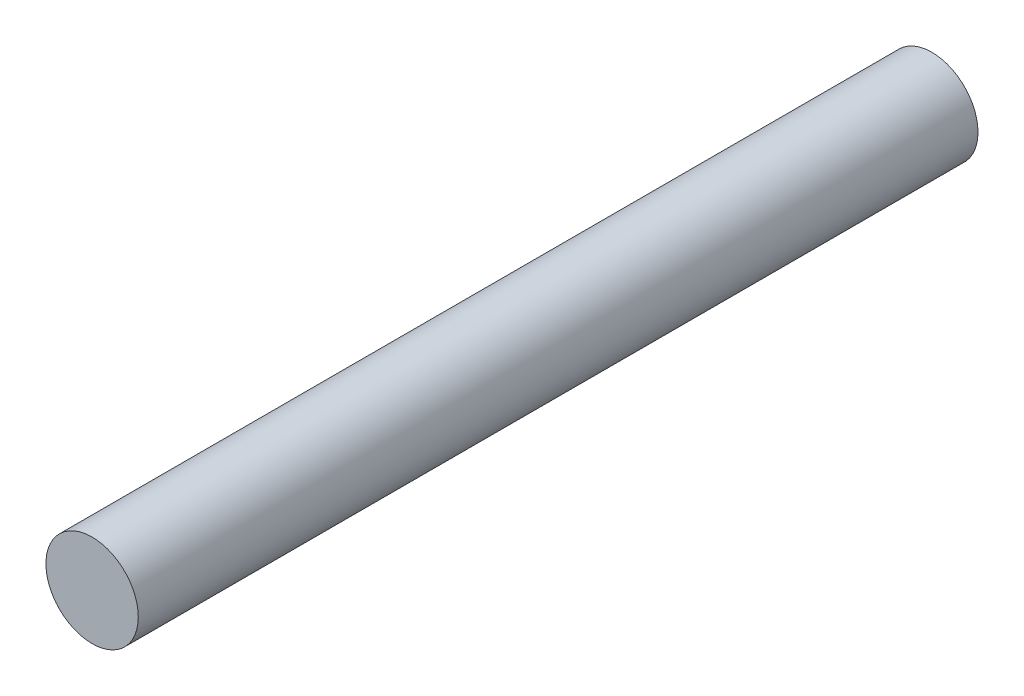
from build123d import *

# Parameters (mm, degrees)
SKETCH1_R           = 0.55
BOSS_EXTRUDE1_DEPTH = 5


with BuildPart() as part:
    # Sketch1 → Boss-Extrude1 (new, symmetric)
    with BuildSketch(Plane.XY):
        Circle(SKETCH1_R)
    extrude(amount=BOSS_EXTRUDE1_DEPTH, both=True)


solid = part.part
